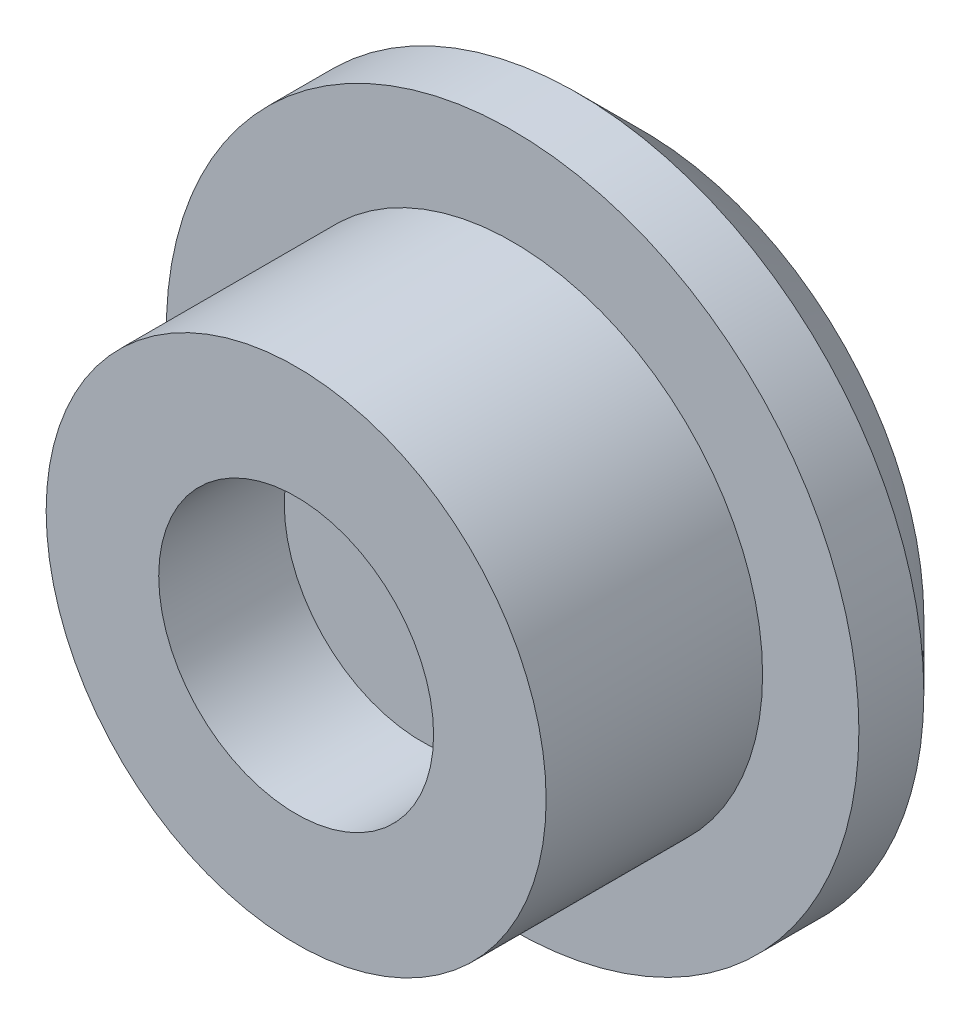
from build123d import *

# Parameters (mm, degrees)
SKETCH1_R           = 5.775
BOSS_EXTRUDE1_DEPTH = 5
SKETCH2_R           = 8
BOSS_EXTRUDE2_DEPTH = 3
SKETCH3_R           = 3.175
CUT_EXTRUDE1_DEPTH  = 2.9
CHAMFER1_SIZE       = 1.5


with BuildPart() as part:
    # Sketch1 → Boss-Extrude1 (new body)
    with BuildSketch(Plane.XY):
        Circle(SKETCH1_R)
    extrude(amount=BOSS_EXTRUDE1_DEPTH)

    # Sketch2 → Boss-Extrude2 (add)
    with BuildSketch(Plane.XY):
        Circle(SKETCH2_R)
    extrude(amount=-BOSS_EXTRUDE2_DEPTH)

    # Sketch3 → Cut-Extrude1 (cut)
    with BuildSketch(Plane.XY.offset(5)):
        Circle(SKETCH3_R)
    extrude(amount=-CUT_EXTRUDE1_DEPTH, mode=Mode.SUBTRACT)

    # Chamfer1
    chamfer1_edges = [part.edges().sort_by_distance(p)[0] for p in [
        (-8, 0, -3),
    ]]
    chamfer(chamfer1_edges, length=CHAMFER1_SIZE)


solid = part.part
